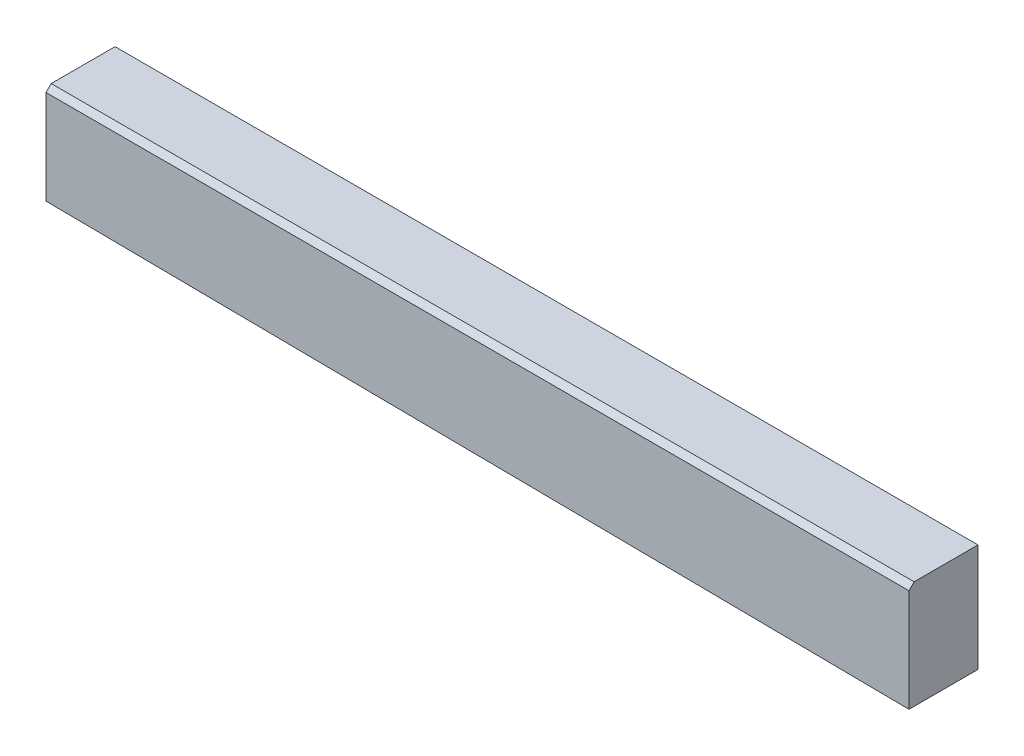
from build123d import *

# Parameters (mm, degrees)
BASEKEY_DEPTH = 4
CHAMFER1_SIZE = 0.6


with BuildPart() as part:
    # Sketch1 → BaseKey (new, symmetric)
    with BuildSketch(Plane.XY):
        Polygon((-100, 24), (0, 24), (0, 11.499983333), (-100, 12.500016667), align=None)
    extrude(amount=BASEKEY_DEPTH, both=True)

    # Chamfer1
    chamfer1_edges = [part.edges().sort_by_distance(p)[0] for p in [
        (-50, 24, 4),
    ]]
    chamfer(chamfer1_edges, length=CHAMFER1_SIZE)


solid = part.part
